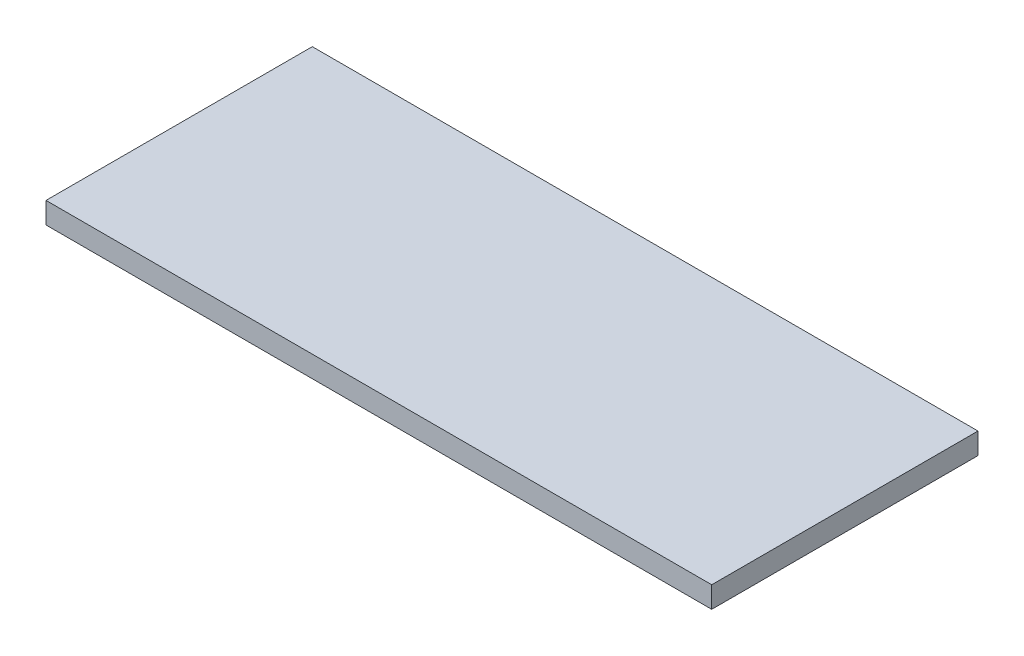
ISO-10303-21;
HEADER;
FILE_DESCRIPTION(('STEP AP214'),'2;1');
FILE_NAME('part.step','',(''),(''),'','','');
FILE_SCHEMA(('AUTOMOTIVE_DESIGN { 1 0 10303 214 1 1 1 1 }'));
ENDSEC;
DATA;
#1=APPLICATION_CONTEXT('core data for automotive mechanical design processes');
#2=APPLICATION_PROTOCOL_DEFINITION('international standard','automotive_design',2000,#1);
#3=PRODUCT_CONTEXT('',#1,'mechanical');
#4=PRODUCT('Part','Part','',(#3));
#5=PRODUCT_RELATED_PRODUCT_CATEGORY('part','',(#4));
#6=PRODUCT_DEFINITION_FORMATION('','',#4);
#7=PRODUCT_DEFINITION_CONTEXT('part definition',#1,'design');
#8=PRODUCT_DEFINITION('design','',#6,#7);
#9=PRODUCT_DEFINITION_SHAPE('','',#8);
#10=(LENGTH_UNIT() NAMED_UNIT(*) SI_UNIT(.MILLI.,.METRE.));
#11=(NAMED_UNIT(*) PLANE_ANGLE_UNIT() SI_UNIT($,.RADIAN.));
#12=(NAMED_UNIT(*) SI_UNIT($,.STERADIAN.) SOLID_ANGLE_UNIT());
#13=UNCERTAINTY_MEASURE_WITH_UNIT(LENGTH_MEASURE(1.E-05),#10,'distance_accuracy_value','');
#14=(GEOMETRIC_REPRESENTATION_CONTEXT(3) GLOBAL_UNCERTAINTY_ASSIGNED_CONTEXT((#13)) GLOBAL_UNIT_ASSIGNED_CONTEXT((#10,
#11,#12)) REPRESENTATION_CONTEXT('',''));
#15=CARTESIAN_POINT('',(0.,0.,0.));
#16=DIRECTION('',(0.,0.,1.));
#17=DIRECTION('',(1.,0.,0.));
#18=AXIS2_PLACEMENT_3D('',#15,#16,#17);
#19=CARTESIAN_POINT('',(31.75,2.032,-12.7));
#20=DIRECTION('',(-1.,0.,0.));
#21=DIRECTION('',(0.,0.,1.));
#22=AXIS2_PLACEMENT_3D('',#19,#20,#21);
#23=PLANE('',#22);
#24=DIRECTION('',(0.,0.,-1.));
#25=VECTOR('',#24,1.);
#26=CARTESIAN_POINT('',(31.75,0.,-12.7));
#27=LINE('',#26,#25);
#28=CARTESIAN_POINT('',(31.75,0.,12.7));
#29=VERTEX_POINT('',#28);
#30=CARTESIAN_POINT('',(31.75,0.,-12.7));
#31=VERTEX_POINT('',#30);
#32=EDGE_CURVE('E96',#29,#31,#27,.T.);
#33=ORIENTED_EDGE('',*,*,#32,.T.);
#34=DIRECTION('',(0.,-1.,0.));
#35=VECTOR('',#34,1.);
#36=CARTESIAN_POINT('',(31.75,2.032,-12.7));
#37=LINE('',#36,#35);
#38=CARTESIAN_POINT('',(31.75,2.032,-12.7));
#39=VERTEX_POINT('',#38);
#40=EDGE_CURVE('E11',#39,#31,#37,.T.);
#41=ORIENTED_EDGE('',*,*,#40,.F.);
#42=DIRECTION('',(0.,0.,-1.));
#43=VECTOR('',#42,1.);
#44=CARTESIAN_POINT('',(31.75,2.032,-12.7));
#45=LINE('',#44,#43);
#46=CARTESIAN_POINT('',(31.75,2.032,12.7));
#47=VERTEX_POINT('',#46);
#48=EDGE_CURVE('E84',#47,#39,#45,.T.);
#49=ORIENTED_EDGE('',*,*,#48,.F.);
#50=DIRECTION('',(0.,-1.,0.));
#51=VECTOR('',#50,1.);
#52=CARTESIAN_POINT('',(31.75,2.032,12.7));
#53=LINE('',#52,#51);
#54=EDGE_CURVE('E92',#47,#29,#53,.T.);
#55=ORIENTED_EDGE('',*,*,#54,.T.);
#56=EDGE_LOOP('',(#33,#41,#49,#55));
#57=FACE_BOUND('',#56,.T.);
#58=ADVANCED_FACE('F33',(#57),#23,.F.);
#59=CARTESIAN_POINT('',(-31.75,2.032,-12.7));
#60=DIRECTION('',(0.,0.,1.));
#61=DIRECTION('',(1.,0.,0.));
#62=AXIS2_PLACEMENT_3D('',#59,#60,#61);
#63=PLANE('',#62);
#64=DIRECTION('',(-1.,0.,0.));
#65=VECTOR('',#64,1.);
#66=CARTESIAN_POINT('',(-31.75,0.,-12.7));
#67=LINE('',#66,#65);
#68=CARTESIAN_POINT('',(-31.75,0.,-12.7));
#69=VERTEX_POINT('',#68);
#70=EDGE_CURVE('E88',#31,#69,#67,.T.);
#71=ORIENTED_EDGE('',*,*,#70,.T.);
#72=DIRECTION('',(0.,-1.,0.));
#73=VECTOR('',#72,1.);
#74=CARTESIAN_POINT('',(-31.75,2.032,-12.7));
#75=LINE('',#74,#73);
#76=CARTESIAN_POINT('',(-31.75,2.032,-12.7));
#77=VERTEX_POINT('',#76);
#78=EDGE_CURVE('E41',#77,#69,#75,.T.);
#79=ORIENTED_EDGE('',*,*,#78,.F.);
#80=DIRECTION('',(-1.,0.,0.));
#81=VECTOR('',#80,1.);
#82=CARTESIAN_POINT('',(-31.75,2.032,-12.7));
#83=LINE('',#82,#81);
#84=EDGE_CURVE('E79',#39,#77,#83,.T.);
#85=ORIENTED_EDGE('',*,*,#84,.F.);
#86=ORIENTED_EDGE('',*,*,#40,.T.);
#87=EDGE_LOOP('',(#71,#79,#85,#86));
#88=FACE_BOUND('',#87,.T.);
#89=ADVANCED_FACE('F87',(#88),#63,.F.);
#90=CARTESIAN_POINT('',(-31.75,2.032,-12.7));
#91=DIRECTION('',(1.,0.,0.));
#92=DIRECTION('',(0.,0.,-1.));
#93=AXIS2_PLACEMENT_3D('',#90,#91,#92);
#94=PLANE('',#93);
#95=DIRECTION('',(0.,0.,1.));
#96=VECTOR('',#95,1.);
#97=CARTESIAN_POINT('',(-31.75,0.,-12.7));
#98=LINE('',#97,#96);
#99=CARTESIAN_POINT('',(-31.75,0.,12.7));
#100=VERTEX_POINT('',#99);
#101=EDGE_CURVE('E66',#69,#100,#98,.T.);
#102=ORIENTED_EDGE('',*,*,#101,.T.);
#103=DIRECTION('',(0.,-1.,0.));
#104=VECTOR('',#103,1.);
#105=CARTESIAN_POINT('',(-31.75,2.032,12.7));
#106=LINE('',#105,#104);
#107=CARTESIAN_POINT('',(-31.75,2.032,12.7));
#108=VERTEX_POINT('',#107);
#109=EDGE_CURVE('E89',#108,#100,#106,.T.);
#110=ORIENTED_EDGE('',*,*,#109,.F.);
#111=DIRECTION('',(0.,0.,1.));
#112=VECTOR('',#111,1.);
#113=CARTESIAN_POINT('',(-31.75,2.032,-12.7));
#114=LINE('',#113,#112);
#115=EDGE_CURVE('E82',#77,#108,#114,.T.);
#116=ORIENTED_EDGE('',*,*,#115,.F.);
#117=ORIENTED_EDGE('',*,*,#78,.T.);
#118=EDGE_LOOP('',(#102,#110,#116,#117));
#119=FACE_BOUND('',#118,.T.);
#120=ADVANCED_FACE('F90',(#119),#94,.F.);
#121=CARTESIAN_POINT('',(-31.75,2.032,12.7));
#122=DIRECTION('',(0.,0.,-1.));
#123=DIRECTION('',(-1.,0.,0.));
#124=AXIS2_PLACEMENT_3D('',#121,#122,#123);
#125=PLANE('',#124);
#126=DIRECTION('',(1.,0.,0.));
#127=VECTOR('',#126,1.);
#128=CARTESIAN_POINT('',(-31.75,0.,12.7));
#129=LINE('',#128,#127);
#130=EDGE_CURVE('E72',#100,#29,#129,.T.);
#131=ORIENTED_EDGE('',*,*,#130,.T.);
#132=ORIENTED_EDGE('',*,*,#54,.F.);
#133=DIRECTION('',(1.,0.,0.));
#134=VECTOR('',#133,1.);
#135=CARTESIAN_POINT('',(-31.75,2.032,12.7));
#136=LINE('',#135,#134);
#137=EDGE_CURVE('E49',#108,#47,#136,.T.);
#138=ORIENTED_EDGE('',*,*,#137,.F.);
#139=ORIENTED_EDGE('',*,*,#109,.T.);
#140=EDGE_LOOP('',(#131,#132,#138,#139));
#141=FACE_BOUND('',#140,.T.);
#142=ADVANCED_FACE('F103',(#141),#125,.F.);
#143=CARTESIAN_POINT('',(0.,2.032,0.));
#144=DIRECTION('',(0.,1.,0.));
#145=DIRECTION('',(0.,0.,1.));
#146=AXIS2_PLACEMENT_3D('',#143,#144,#145);
#147=PLANE('',#146);
#148=ORIENTED_EDGE('',*,*,#48,.T.);
#149=ORIENTED_EDGE('',*,*,#84,.T.);
#150=ORIENTED_EDGE('',*,*,#115,.T.);
#151=ORIENTED_EDGE('',*,*,#137,.T.);
#152=EDGE_LOOP('',(#148,#149,#150,#151));
#153=FACE_BOUND('',#152,.T.);
#154=ADVANCED_FACE('F80',(#153),#147,.T.);
#155=CARTESIAN_POINT('',(0.,0.,0.));
#156=DIRECTION('',(0.,1.,0.));
#157=DIRECTION('',(0.,0.,1.));
#158=AXIS2_PLACEMENT_3D('',#155,#156,#157);
#159=PLANE('',#158);
#160=ORIENTED_EDGE('',*,*,#32,.F.);
#161=ORIENTED_EDGE('',*,*,#130,.F.);
#162=ORIENTED_EDGE('',*,*,#101,.F.);
#163=ORIENTED_EDGE('',*,*,#70,.F.);
#164=EDGE_LOOP('',(#160,#161,#162,#163));
#165=FACE_BOUND('',#164,.T.);
#166=ADVANCED_FACE('F106',(#165),#159,.F.);
#167=CLOSED_SHELL('',(#58,#89,#120,#142,#154,#166));
#168=MANIFOLD_SOLID_BREP('B2',#167);
#169=ADVANCED_BREP_SHAPE_REPRESENTATION('',(#18,#168),#14);
#170=SHAPE_DEFINITION_REPRESENTATION(#9,#169);
ENDSEC;
END-ISO-10303-21;
